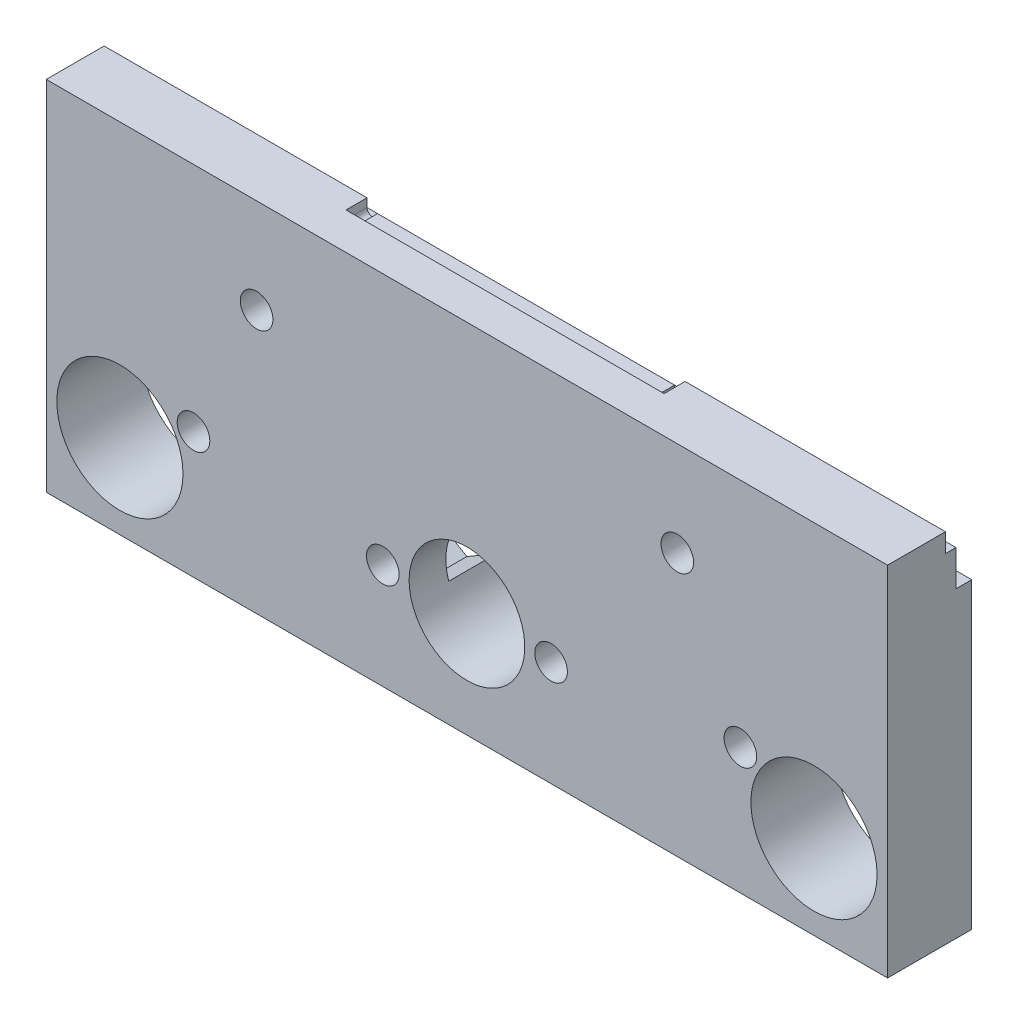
ISO-10303-21;
HEADER;
FILE_DESCRIPTION(('STEP AP214'),'2;1');
FILE_NAME('part.step','',(''),(''),'','','');
FILE_SCHEMA(('AUTOMOTIVE_DESIGN { 1 0 10303 214 1 1 1 1 }'));
ENDSEC;
DATA;
#1=APPLICATION_CONTEXT('core data for automotive mechanical design processes');
#2=APPLICATION_PROTOCOL_DEFINITION('international standard','automotive_design',2000,#1);
#3=PRODUCT_CONTEXT('',#1,'mechanical');
#4=PRODUCT('Part','Part','',(#3));
#5=PRODUCT_RELATED_PRODUCT_CATEGORY('part','',(#4));
#6=PRODUCT_DEFINITION_FORMATION('','',#4);
#7=PRODUCT_DEFINITION_CONTEXT('part definition',#1,'design');
#8=PRODUCT_DEFINITION('design','',#6,#7);
#9=PRODUCT_DEFINITION_SHAPE('','',#8);
#10=(LENGTH_UNIT() NAMED_UNIT(*) SI_UNIT(.MILLI.,.METRE.));
#11=(NAMED_UNIT(*) PLANE_ANGLE_UNIT() SI_UNIT($,.RADIAN.));
#12=(NAMED_UNIT(*) SI_UNIT($,.STERADIAN.) SOLID_ANGLE_UNIT());
#13=UNCERTAINTY_MEASURE_WITH_UNIT(LENGTH_MEASURE(1.E-05),#10,'distance_accuracy_value','');
#14=(GEOMETRIC_REPRESENTATION_CONTEXT(3) GLOBAL_UNCERTAINTY_ASSIGNED_CONTEXT((#13)) GLOBAL_UNIT_ASSIGNED_CONTEXT((#10,
#11,#12)) REPRESENTATION_CONTEXT('',''));
#15=CARTESIAN_POINT('',(0.,0.,0.));
#16=DIRECTION('',(0.,0.,1.));
#17=DIRECTION('',(1.,0.,0.));
#18=AXIS2_PLACEMENT_3D('',#15,#16,#17);
#19=CARTESIAN_POINT('',(32.,10.,0.));
#20=DIRECTION('',(0.,0.,1.));
#21=DIRECTION('',(1.,0.,0.));
#22=AXIS2_PLACEMENT_3D('',#19,#20,#21);
#23=CYLINDRICAL_SURFACE('',#22,1.55);
#24=CARTESIAN_POINT('',(32.,10.,8.));
#25=DIRECTION('',(0.,0.,1.));
#26=DIRECTION('',(1.,0.,0.));
#27=AXIS2_PLACEMENT_3D('',#24,#25,#26);
#28=CIRCLE('',#27,1.55);
#29=CARTESIAN_POINT('',(33.55,10.,8.));
#30=VERTEX_POINT('',#29);
#31=EDGE_CURVE('E259',#30,#30,#28,.T.);
#32=ORIENTED_EDGE('',*,*,#31,.T.);
#33=EDGE_LOOP('',(#32));
#34=FACE_BOUND('',#33,.T.);
#35=CARTESIAN_POINT('',(32.,10.,4.5));
#36=DIRECTION('',(0.,0.,-1.));
#37=DIRECTION('',(-1.,0.,0.));
#38=AXIS2_PLACEMENT_3D('',#35,#36,#37);
#39=CIRCLE('',#38,1.55);
#40=CARTESIAN_POINT('',(30.45,10.,4.5));
#41=VERTEX_POINT('',#40);
#42=EDGE_CURVE('E262',#41,#41,#39,.F.);
#43=ORIENTED_EDGE('',*,*,#42,.F.);
#44=EDGE_LOOP('',(#43));
#45=FACE_BOUND('',#44,.T.);
#46=ADVANCED_FACE('F33',(#34,#45),#23,.F.);
#47=CARTESIAN_POINT('',(48.,10.,0.));
#48=DIRECTION('',(0.,0.,1.));
#49=DIRECTION('',(1.,0.,0.));
#50=AXIS2_PLACEMENT_3D('',#47,#48,#49);
#51=CYLINDRICAL_SURFACE('',#50,1.55);
#52=CARTESIAN_POINT('',(48.,10.,8.));
#53=DIRECTION('',(0.,0.,1.));
#54=DIRECTION('',(1.,0.,0.));
#55=AXIS2_PLACEMENT_3D('',#52,#53,#54);
#56=CIRCLE('',#55,1.55);
#57=CARTESIAN_POINT('',(49.55,10.,8.));
#58=VERTEX_POINT('',#57);
#59=EDGE_CURVE('E255',#58,#58,#56,.T.);
#60=ORIENTED_EDGE('',*,*,#59,.T.);
#61=EDGE_LOOP('',(#60));
#62=FACE_BOUND('',#61,.T.);
#63=CARTESIAN_POINT('',(48.,10.,4.5));
#64=DIRECTION('',(0.,0.,-1.));
#65=DIRECTION('',(-1.,0.,0.));
#66=AXIS2_PLACEMENT_3D('',#63,#64,#65);
#67=CIRCLE('',#66,1.55);
#68=CARTESIAN_POINT('',(46.45,10.,4.5));
#69=VERTEX_POINT('',#68);
#70=EDGE_CURVE('E337',#69,#69,#67,.F.);
#71=ORIENTED_EDGE('',*,*,#70,.F.);
#72=EDGE_LOOP('',(#71));
#73=FACE_BOUND('',#72,.T.);
#74=ADVANCED_FACE('F346',(#62,#73),#51,.F.);
#75=CARTESIAN_POINT('',(0.,0.,8.));
#76=DIRECTION('',(0.,0.,1.));
#77=DIRECTION('',(1.,0.,0.));
#78=AXIS2_PLACEMENT_3D('',#75,#76,#77);
#79=PLANE('',#78);
#80=CARTESIAN_POINT('',(40.,10.,8.));
#81=DIRECTION('',(0.,0.,-1.));
#82=DIRECTION('',(-1.,0.,0.));
#83=AXIS2_PLACEMENT_3D('',#80,#81,#82);
#84=CIRCLE('',#83,5.5);
#85=CARTESIAN_POINT('',(34.5,10.,8.));
#86=VERTEX_POINT('',#85);
#87=EDGE_CURVE('E226',#86,#86,#84,.T.);
#88=ORIENTED_EDGE('',*,*,#87,.T.);
#89=EDGE_LOOP('',(#88));
#90=FACE_BOUND('',#89,.T.);
#91=CARTESIAN_POINT('',(66.,11.9999999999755,8.));
#92=DIRECTION('',(0.,0.,-1.));
#93=DIRECTION('',(-1.,0.,0.));
#94=AXIS2_PLACEMENT_3D('',#91,#92,#93);
#95=CIRCLE('',#94,1.54999999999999);
#96=CARTESIAN_POINT('',(64.45,11.9999999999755,8.));
#97=VERTEX_POINT('',#96);
#98=EDGE_CURVE('E546',#97,#97,#95,.T.);
#99=ORIENTED_EDGE('',*,*,#98,.T.);
#100=EDGE_LOOP('',(#99));
#101=FACE_BOUND('',#100,.T.);
#102=CARTESIAN_POINT('',(14.,11.9999999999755,8.));
#103=DIRECTION('',(0.,0.,-1.));
#104=DIRECTION('',(1.,0.,0.));
#105=AXIS2_PLACEMENT_3D('',#102,#103,#104);
#106=CIRCLE('',#105,1.54999999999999);
#107=CARTESIAN_POINT('',(15.55,11.9999999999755,8.));
#108=VERTEX_POINT('',#107);
#109=EDGE_CURVE('E541',#108,#108,#106,.T.);
#110=ORIENTED_EDGE('',*,*,#109,.T.);
#111=EDGE_LOOP('',(#110));
#112=FACE_BOUND('',#111,.T.);
#113=CARTESIAN_POINT('',(60.,25.,8.));
#114=DIRECTION('',(0.,0.,-1.));
#115=DIRECTION('',(-1.,0.,0.));
#116=AXIS2_PLACEMENT_3D('',#113,#114,#115);
#117=CIRCLE('',#116,1.55000000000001);
#118=CARTESIAN_POINT('',(58.45,25.,8.));
#119=VERTEX_POINT('',#118);
#120=EDGE_CURVE('E444',#119,#119,#117,.T.);
#121=ORIENTED_EDGE('',*,*,#120,.T.);
#122=EDGE_LOOP('',(#121));
#123=FACE_BOUND('',#122,.T.);
#124=CARTESIAN_POINT('',(20.,25.,8.));
#125=DIRECTION('',(0.,0.,-1.));
#126=DIRECTION('',(-1.,0.,0.));
#127=AXIS2_PLACEMENT_3D('',#124,#125,#126);
#128=CIRCLE('',#127,1.55);
#129=CARTESIAN_POINT('',(18.45,25.,8.));
#130=VERTEX_POINT('',#129);
#131=EDGE_CURVE('E450',#130,#130,#128,.T.);
#132=ORIENTED_EDGE('',*,*,#131,.T.);
#133=EDGE_LOOP('',(#132));
#134=FACE_BOUND('',#133,.T.);
#135=ORIENTED_EDGE('',*,*,#59,.F.);
#136=EDGE_LOOP('',(#135));
#137=FACE_BOUND('',#136,.T.);
#138=ORIENTED_EDGE('',*,*,#31,.F.);
#139=EDGE_LOOP('',(#138));
#140=FACE_BOUND('',#139,.T.);
#141=DIRECTION('',(0.,-1.,0.));
#142=VECTOR('',#141,1.);
#143=CARTESIAN_POINT('',(0.,34.,8.));
#144=LINE('',#143,#142);
#145=CARTESIAN_POINT('',(0.,34.,8.));
#146=VERTEX_POINT('',#145);
#147=CARTESIAN_POINT('',(0.,0.,8.));
#148=VERTEX_POINT('',#147);
#149=EDGE_CURVE('E311',#146,#148,#144,.T.);
#150=ORIENTED_EDGE('',*,*,#149,.T.);
#151=DIRECTION('',(1.,0.,0.));
#152=VECTOR('',#151,1.);
#153=CARTESIAN_POINT('',(0.,0.,8.));
#154=LINE('',#153,#152);
#155=CARTESIAN_POINT('',(80.,0.,8.));
#156=VERTEX_POINT('',#155);
#157=EDGE_CURVE('E314',#148,#156,#154,.T.);
#158=ORIENTED_EDGE('',*,*,#157,.T.);
#159=DIRECTION('',(0.,1.,0.));
#160=VECTOR('',#159,1.);
#161=CARTESIAN_POINT('',(80.,0.,8.));
#162=LINE('',#161,#160);
#163=CARTESIAN_POINT('',(80.,34.,8.));
#164=VERTEX_POINT('',#163);
#165=EDGE_CURVE('E317',#156,#164,#162,.T.);
#166=ORIENTED_EDGE('',*,*,#165,.T.);
#167=DIRECTION('',(-1.,0.,0.));
#168=VECTOR('',#167,1.);
#169=CARTESIAN_POINT('',(80.,34.,8.));
#170=LINE('',#169,#168);
#171=EDGE_CURVE('E319',#164,#146,#170,.T.);
#172=ORIENTED_EDGE('',*,*,#171,.T.);
#173=EDGE_LOOP('',(#150,#158,#166,#172));
#174=FACE_BOUND('',#173,.T.);
#175=CARTESIAN_POINT('',(7.,8.,8.));
#176=DIRECTION('',(0.,0.,1.));
#177=DIRECTION('',(1.,0.,0.));
#178=AXIS2_PLACEMENT_3D('',#175,#176,#177);
#179=CIRCLE('',#178,6.);
#180=CARTESIAN_POINT('',(13.,8.,8.));
#181=VERTEX_POINT('',#180);
#182=EDGE_CURVE('E305',#181,#181,#179,.T.);
#183=ORIENTED_EDGE('',*,*,#182,.F.);
#184=EDGE_LOOP('',(#183));
#185=FACE_BOUND('',#184,.T.);
#186=CARTESIAN_POINT('',(73.,8.,8.));
#187=DIRECTION('',(0.,0.,1.));
#188=DIRECTION('',(1.,0.,0.));
#189=AXIS2_PLACEMENT_3D('',#186,#187,#188);
#190=CIRCLE('',#189,6.);
#191=CARTESIAN_POINT('',(79.,8.,8.));
#192=VERTEX_POINT('',#191);
#193=EDGE_CURVE('E299',#192,#192,#190,.T.);
#194=ORIENTED_EDGE('',*,*,#193,.F.);
#195=EDGE_LOOP('',(#194));
#196=FACE_BOUND('',#195,.T.);
#197=ADVANCED_FACE('F352',(#90,#101,#112,#123,#134,#137,#140,#174,#185,#196),#79,.T.);
#198=CARTESIAN_POINT('',(0.,0.,0.));
#199=DIRECTION('',(0.,0.,1.));
#200=DIRECTION('',(1.,0.,0.));
#201=AXIS2_PLACEMENT_3D('',#198,#199,#200);
#202=PLANE('',#201);
#203=CARTESIAN_POINT('',(66.,11.9999999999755,0.));
#204=DIRECTION('',(0.,0.,-1.));
#205=DIRECTION('',(-1.,0.,0.));
#206=AXIS2_PLACEMENT_3D('',#203,#204,#205);
#207=CIRCLE('',#206,1.54999999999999);
#208=CARTESIAN_POINT('',(64.45,11.9999999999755,0.));
#209=VERTEX_POINT('',#208);
#210=EDGE_CURVE('E550',#209,#209,#207,.T.);
#211=ORIENTED_EDGE('',*,*,#210,.F.);
#212=EDGE_LOOP('',(#211));
#213=FACE_BOUND('',#212,.T.);
#214=CARTESIAN_POINT('',(14.,11.9999999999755,0.));
#215=DIRECTION('',(0.,0.,-1.));
#216=DIRECTION('',(1.,0.,0.));
#217=AXIS2_PLACEMENT_3D('',#214,#215,#216);
#218=CIRCLE('',#217,1.54999999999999);
#219=CARTESIAN_POINT('',(15.55,11.9999999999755,0.));
#220=VERTEX_POINT('',#219);
#221=EDGE_CURVE('E537',#220,#220,#218,.T.);
#222=ORIENTED_EDGE('',*,*,#221,.F.);
#223=EDGE_LOOP('',(#222));
#224=FACE_BOUND('',#223,.T.);
#225=CARTESIAN_POINT('',(60.,25.,0.));
#226=DIRECTION('',(0.,0.,-1.));
#227=DIRECTION('',(-1.,0.,0.));
#228=AXIS2_PLACEMENT_3D('',#225,#226,#227);
#229=CIRCLE('',#228,1.55000000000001);
#230=CARTESIAN_POINT('',(58.45,25.,0.));
#231=VERTEX_POINT('',#230);
#232=EDGE_CURVE('E447',#231,#231,#229,.T.);
#233=ORIENTED_EDGE('',*,*,#232,.F.);
#234=EDGE_LOOP('',(#233));
#235=FACE_BOUND('',#234,.T.);
#236=CARTESIAN_POINT('',(20.,25.,0.));
#237=DIRECTION('',(0.,0.,-1.));
#238=DIRECTION('',(-1.,0.,0.));
#239=AXIS2_PLACEMENT_3D('',#236,#237,#238);
#240=CIRCLE('',#239,1.55);
#241=CARTESIAN_POINT('',(18.45,25.,0.));
#242=VERTEX_POINT('',#241);
#243=EDGE_CURVE('E453',#242,#242,#240,.T.);
#244=ORIENTED_EDGE('',*,*,#243,.F.);
#245=EDGE_LOOP('',(#244));
#246=FACE_BOUND('',#245,.T.);
#247=DIRECTION('',(0.866025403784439,0.5,0.));
#248=VECTOR('',#247,1.);
#249=CARTESIAN_POINT('',(45.15,11.6454482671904,0.));
#250=LINE('',#249,#248);
#251=CARTESIAN_POINT('',(45.2328562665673,11.6932853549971,0.));
#252=VERTEX_POINT('',#251);
#253=CARTESIAN_POINT('',(48.,13.2908965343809,0.));
#254=VERTEX_POINT('',#253);
#255=EDGE_CURVE('E225',#252,#254,#250,.T.);
#256=ORIENTED_EDGE('',*,*,#255,.F.);
#257=CARTESIAN_POINT('',(40.,10.,0.));
#258=DIRECTION('',(0.,0.,-1.));
#259=DIRECTION('',(-1.,0.,0.));
#260=AXIS2_PLACEMENT_3D('',#257,#258,#259);
#261=CIRCLE('',#260,5.5);
#262=CARTESIAN_POINT('',(34.7671437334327,11.6932853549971,0.));
#263=VERTEX_POINT('',#262);
#264=EDGE_CURVE('E207',#263,#252,#261,.T.);
#265=ORIENTED_EDGE('',*,*,#264,.F.);
#266=DIRECTION('',(0.866025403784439,-0.499999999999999,0.));
#267=VECTOR('',#266,1.);
#268=CARTESIAN_POINT('',(32.,13.2908965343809,0.));
#269=LINE('',#268,#267);
#270=CARTESIAN_POINT('',(32.,13.2908965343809,0.));
#271=VERTEX_POINT('',#270);
#272=EDGE_CURVE('E223',#271,#263,#269,.T.);
#273=ORIENTED_EDGE('',*,*,#272,.F.);
#274=DIRECTION('',(0.866025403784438,0.500000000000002,0.));
#275=VECTOR('',#274,1.);
#276=CARTESIAN_POINT('',(29.15,11.6454482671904,0.));
#277=LINE('',#276,#275);
#278=CARTESIAN_POINT('',(29.15,11.6454482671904,0.));
#279=VERTEX_POINT('',#278);
#280=EDGE_CURVE('E254',#279,#271,#277,.T.);
#281=ORIENTED_EDGE('',*,*,#280,.F.);
#282=DIRECTION('',(0.,1.,0.));
#283=VECTOR('',#282,1.);
#284=CARTESIAN_POINT('',(29.15,8.35455173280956,0.));
#285=LINE('',#284,#283);
#286=CARTESIAN_POINT('',(29.15,8.35455173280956,0.));
#287=VERTEX_POINT('',#286);
#288=EDGE_CURVE('E497',#287,#279,#285,.T.);
#289=ORIENTED_EDGE('',*,*,#288,.F.);
#290=DIRECTION('',(-0.866025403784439,0.499999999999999,0.));
#291=VECTOR('',#290,1.);
#292=CARTESIAN_POINT('',(32.,6.70910346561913,0.));
#293=LINE('',#292,#291);
#294=CARTESIAN_POINT('',(32.,6.70910346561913,0.));
#295=VERTEX_POINT('',#294);
#296=EDGE_CURVE('E236',#295,#287,#293,.T.);
#297=ORIENTED_EDGE('',*,*,#296,.F.);
#298=DIRECTION('',(-0.866025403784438,-0.500000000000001,0.));
#299=VECTOR('',#298,1.);
#300=CARTESIAN_POINT('',(34.85,8.35455173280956,0.));
#301=LINE('',#300,#299);
#302=CARTESIAN_POINT('',(34.7671437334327,8.3067146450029,0.));
#303=VERTEX_POINT('',#302);
#304=EDGE_CURVE('E232',#303,#295,#301,.T.);
#305=ORIENTED_EDGE('',*,*,#304,.F.);
#306=CARTESIAN_POINT('',(45.2328562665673,8.30671464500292,0.));
#307=VERTEX_POINT('',#306);
#308=EDGE_CURVE('E48',#307,#303,#261,.T.);
#309=ORIENTED_EDGE('',*,*,#308,.F.);
#310=DIRECTION('',(-0.866025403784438,0.5,0.));
#311=VECTOR('',#310,1.);
#312=CARTESIAN_POINT('',(48.,6.70910346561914,0.));
#313=LINE('',#312,#311);
#314=CARTESIAN_POINT('',(48.,6.70910346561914,0.));
#315=VERTEX_POINT('',#314);
#316=EDGE_CURVE('E477',#315,#307,#313,.T.);
#317=ORIENTED_EDGE('',*,*,#316,.F.);
#318=DIRECTION('',(-0.866025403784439,-0.5,0.));
#319=VECTOR('',#318,1.);
#320=CARTESIAN_POINT('',(50.85,8.35455173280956,0.));
#321=LINE('',#320,#319);
#322=CARTESIAN_POINT('',(50.85,8.35455173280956,0.));
#323=VERTEX_POINT('',#322);
#324=EDGE_CURVE('E474',#323,#315,#321,.T.);
#325=ORIENTED_EDGE('',*,*,#324,.F.);
#326=DIRECTION('',(0.,-1.,0.));
#327=VECTOR('',#326,1.);
#328=CARTESIAN_POINT('',(50.85,11.6454482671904,0.));
#329=LINE('',#328,#327);
#330=CARTESIAN_POINT('',(50.85,11.6454482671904,0.));
#331=VERTEX_POINT('',#330);
#332=EDGE_CURVE('E234',#331,#323,#329,.T.);
#333=ORIENTED_EDGE('',*,*,#332,.F.);
#334=DIRECTION('',(0.866025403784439,-0.5,0.));
#335=VECTOR('',#334,1.);
#336=CARTESIAN_POINT('',(48.,13.2908965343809,0.));
#337=LINE('',#336,#335);
#338=EDGE_CURVE('E231',#254,#331,#337,.T.);
#339=ORIENTED_EDGE('',*,*,#338,.F.);
#340=EDGE_LOOP('',(#256,#265,#273,#281,#289,#297,#305,#309,#317,#325,#333,#339));
#341=FACE_BOUND('',#340,.T.);
#342=DIRECTION('',(0.,-1.,0.));
#343=VECTOR('',#342,1.);
#344=CARTESIAN_POINT('',(0.,34.,0.));
#345=LINE('',#344,#343);
#346=CARTESIAN_POINT('',(0.,28.7999999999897,0.));
#347=VERTEX_POINT('',#346);
#348=CARTESIAN_POINT('',(0.,0.,0.));
#349=VERTEX_POINT('',#348);
#350=EDGE_CURVE('E308',#347,#349,#345,.T.);
#351=ORIENTED_EDGE('',*,*,#350,.F.);
#352=DIRECTION('',(1.,0.,0.));
#353=VECTOR('',#352,1.);
#354=CARTESIAN_POINT('',(0.,28.7999999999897,0.));
#355=LINE('',#354,#353);
#356=CARTESIAN_POINT('',(80.,28.7999999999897,0.));
#357=VERTEX_POINT('',#356);
#358=EDGE_CURVE('E286',#347,#357,#355,.T.);
#359=ORIENTED_EDGE('',*,*,#358,.T.);
#360=DIRECTION('',(0.,1.,0.));
#361=VECTOR('',#360,1.);
#362=CARTESIAN_POINT('',(80.,0.,0.));
#363=LINE('',#362,#361);
#364=CARTESIAN_POINT('',(80.,0.,0.));
#365=VERTEX_POINT('',#364);
#366=EDGE_CURVE('E315',#365,#357,#363,.T.);
#367=ORIENTED_EDGE('',*,*,#366,.F.);
#368=DIRECTION('',(1.,0.,0.));
#369=VECTOR('',#368,1.);
#370=CARTESIAN_POINT('',(0.,0.,0.));
#371=LINE('',#370,#369);
#372=EDGE_CURVE('E323',#349,#365,#371,.T.);
#373=ORIENTED_EDGE('',*,*,#372,.F.);
#374=EDGE_LOOP('',(#351,#359,#367,#373));
#375=FACE_BOUND('',#374,.T.);
#376=CARTESIAN_POINT('',(7.,8.,0.));
#377=DIRECTION('',(0.,0.,1.));
#378=DIRECTION('',(1.,0.,0.));
#379=AXIS2_PLACEMENT_3D('',#376,#377,#378);
#380=CIRCLE('',#379,6.);
#381=CARTESIAN_POINT('',(13.,8.,0.));
#382=VERTEX_POINT('',#381);
#383=EDGE_CURVE('E302',#382,#382,#380,.T.);
#384=ORIENTED_EDGE('',*,*,#383,.T.);
#385=EDGE_LOOP('',(#384));
#386=FACE_BOUND('',#385,.T.);
#387=CARTESIAN_POINT('',(73.,8.,0.));
#388=DIRECTION('',(0.,0.,1.));
#389=DIRECTION('',(1.,0.,0.));
#390=AXIS2_PLACEMENT_3D('',#387,#388,#389);
#391=CIRCLE('',#390,6.);
#392=CARTESIAN_POINT('',(79.,8.,0.));
#393=VERTEX_POINT('',#392);
#394=EDGE_CURVE('E289',#393,#393,#391,.T.);
#395=ORIENTED_EDGE('',*,*,#394,.T.);
#396=EDGE_LOOP('',(#395));
#397=FACE_BOUND('',#396,.T.);
#398=ADVANCED_FACE('F220',(#213,#224,#235,#246,#341,#375,#386,#397),#202,.F.);
#399=CARTESIAN_POINT('',(0.,34.,8.));
#400=DIRECTION('',(1.,0.,0.));
#401=DIRECTION('',(0.,0.,-1.));
#402=AXIS2_PLACEMENT_3D('',#399,#400,#401);
#403=PLANE('',#402);
#404=DIRECTION('',(0.,-1.,0.));
#405=VECTOR('',#404,1.);
#406=CARTESIAN_POINT('',(0.,32.2,1.5));
#407=LINE('',#406,#405);
#408=CARTESIAN_POINT('',(0.,32.2,1.5));
#409=VERTEX_POINT('',#408);
#410=CARTESIAN_POINT('',(0.,28.8,1.5));
#411=VERTEX_POINT('',#410);
#412=EDGE_CURVE('E270',#409,#411,#407,.T.);
#413=ORIENTED_EDGE('',*,*,#412,.T.);
#414=DIRECTION('',(0.,-6.85562717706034E-12,-1.));
#415=VECTOR('',#414,1.);
#416=CARTESIAN_POINT('',(0.,28.8,1.5));
#417=LINE('',#416,#415);
#418=EDGE_CURVE('E273',#411,#347,#417,.T.);
#419=ORIENTED_EDGE('',*,*,#418,.T.);
#420=ORIENTED_EDGE('',*,*,#350,.T.);
#421=DIRECTION('',(0.,0.,-1.));
#422=VECTOR('',#421,1.);
#423=CARTESIAN_POINT('',(0.,0.,8.));
#424=LINE('',#423,#422);
#425=EDGE_CURVE('E41',#148,#349,#424,.T.);
#426=ORIENTED_EDGE('',*,*,#425,.F.);
#427=ORIENTED_EDGE('',*,*,#149,.F.);
#428=DIRECTION('',(0.,0.,-1.));
#429=VECTOR('',#428,1.);
#430=CARTESIAN_POINT('',(0.,34.,8.));
#431=LINE('',#430,#429);
#432=CARTESIAN_POINT('',(0.,34.,2.5));
#433=VERTEX_POINT('',#432);
#434=EDGE_CURVE('E321',#146,#433,#431,.T.);
#435=ORIENTED_EDGE('',*,*,#434,.T.);
#436=DIRECTION('',(0.,-1.,0.));
#437=VECTOR('',#436,1.);
#438=CARTESIAN_POINT('',(0.,32.2,2.5));
#439=LINE('',#438,#437);
#440=CARTESIAN_POINT('',(0.,32.2,2.5));
#441=VERTEX_POINT('',#440);
#442=EDGE_CURVE('E263',#433,#441,#439,.T.);
#443=ORIENTED_EDGE('',*,*,#442,.T.);
#444=DIRECTION('',(0.,0.,-1.));
#445=VECTOR('',#444,1.);
#446=CARTESIAN_POINT('',(0.,32.2,1.5));
#447=LINE('',#446,#445);
#448=EDGE_CURVE('E266',#441,#409,#447,.T.);
#449=ORIENTED_EDGE('',*,*,#448,.T.);
#450=EDGE_LOOP('',(#413,#419,#420,#426,#427,#435,#443,#449));
#451=FACE_BOUND('',#450,.T.);
#452=ADVANCED_FACE('F35',(#451),#403,.F.);
#453=CARTESIAN_POINT('',(0.,0.,8.));
#454=DIRECTION('',(0.,1.,0.));
#455=DIRECTION('',(0.,0.,1.));
#456=AXIS2_PLACEMENT_3D('',#453,#454,#455);
#457=PLANE('',#456);
#458=ORIENTED_EDGE('',*,*,#372,.T.);
#459=DIRECTION('',(0.,0.,-1.));
#460=VECTOR('',#459,1.);
#461=CARTESIAN_POINT('',(80.,0.,8.));
#462=LINE('',#461,#460);
#463=EDGE_CURVE('E332',#156,#365,#462,.T.);
#464=ORIENTED_EDGE('',*,*,#463,.F.);
#465=ORIENTED_EDGE('',*,*,#157,.F.);
#466=ORIENTED_EDGE('',*,*,#425,.T.);
#467=EDGE_LOOP('',(#458,#464,#465,#466));
#468=FACE_BOUND('',#467,.T.);
#469=ADVANCED_FACE('F394',(#468),#457,.F.);
#470=CARTESIAN_POINT('',(80.,0.,8.));
#471=DIRECTION('',(-1.,0.,0.));
#472=DIRECTION('',(0.,0.,1.));
#473=AXIS2_PLACEMENT_3D('',#470,#471,#472);
#474=PLANE('',#473);
#475=ORIENTED_EDGE('',*,*,#366,.T.);
#476=DIRECTION('',(0.,-6.85562717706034E-12,-1.));
#477=VECTOR('',#476,1.);
#478=CARTESIAN_POINT('',(80.,28.8,1.5));
#479=LINE('',#478,#477);
#480=CARTESIAN_POINT('',(80.,28.8,1.5));
#481=VERTEX_POINT('',#480);
#482=EDGE_CURVE('E267',#481,#357,#479,.T.);
#483=ORIENTED_EDGE('',*,*,#482,.F.);
#484=DIRECTION('',(0.,-1.,0.));
#485=VECTOR('',#484,1.);
#486=CARTESIAN_POINT('',(80.,32.2,1.5));
#487=LINE('',#486,#485);
#488=CARTESIAN_POINT('',(80.,32.2,1.5));
#489=VERTEX_POINT('',#488);
#490=EDGE_CURVE('E282',#489,#481,#487,.T.);
#491=ORIENTED_EDGE('',*,*,#490,.F.);
#492=DIRECTION('',(0.,0.,-1.));
#493=VECTOR('',#492,1.);
#494=CARTESIAN_POINT('',(80.,32.2,1.5));
#495=LINE('',#494,#493);
#496=CARTESIAN_POINT('',(80.,32.2,2.5));
#497=VERTEX_POINT('',#496);
#498=EDGE_CURVE('E279',#497,#489,#495,.T.);
#499=ORIENTED_EDGE('',*,*,#498,.F.);
#500=DIRECTION('',(0.,-1.,0.));
#501=VECTOR('',#500,1.);
#502=CARTESIAN_POINT('',(80.,32.2,2.5));
#503=LINE('',#502,#501);
#504=CARTESIAN_POINT('',(80.,34.,2.5));
#505=VERTEX_POINT('',#504);
#506=EDGE_CURVE('E258',#505,#497,#503,.T.);
#507=ORIENTED_EDGE('',*,*,#506,.F.);
#508=DIRECTION('',(0.,0.,-1.));
#509=VECTOR('',#508,1.);
#510=CARTESIAN_POINT('',(80.,34.,8.));
#511=LINE('',#510,#509);
#512=EDGE_CURVE('E329',#164,#505,#511,.T.);
#513=ORIENTED_EDGE('',*,*,#512,.F.);
#514=ORIENTED_EDGE('',*,*,#165,.F.);
#515=ORIENTED_EDGE('',*,*,#463,.T.);
#516=EDGE_LOOP('',(#475,#483,#491,#499,#507,#513,#514,#515));
#517=FACE_BOUND('',#516,.T.);
#518=ADVANCED_FACE('F391',(#517),#474,.F.);
#519=CARTESIAN_POINT('',(80.,34.,8.));
#520=DIRECTION('',(0.,-1.,0.));
#521=DIRECTION('',(1.,0.,0.));
#522=AXIS2_PLACEMENT_3D('',#519,#520,#521);
#523=PLANE('',#522);
#524=DIRECTION('',(1.,0.,0.));
#525=VECTOR('',#524,1.);
#526=CARTESIAN_POINT('',(25.000000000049,34.,4.49999999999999));
#527=LINE('',#526,#525);
#528=CARTESIAN_POINT('',(25.000000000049,34.,4.49999999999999));
#529=VERTEX_POINT('',#528);
#530=CARTESIAN_POINT('',(55.247938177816,34.,4.49999999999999));
#531=VERTEX_POINT('',#530);
#532=EDGE_CURVE('E431',#529,#531,#527,.T.);
#533=ORIENTED_EDGE('',*,*,#532,.F.);
#534=DIRECTION('',(0.,0.,-1.));
#535=VECTOR('',#534,1.);
#536=CARTESIAN_POINT('',(25.000000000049,34.,4.49999999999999));
#537=LINE('',#536,#535);
#538=CARTESIAN_POINT('',(25.000000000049,34.,2.49999999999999));
#539=VERTEX_POINT('',#538);
#540=EDGE_CURVE('E429',#529,#539,#537,.T.);
#541=ORIENTED_EDGE('',*,*,#540,.T.);
#542=DIRECTION('',(1.,0.,0.));
#543=VECTOR('',#542,1.);
#544=CARTESIAN_POINT('',(0.,34.,2.5));
#545=LINE('',#544,#543);
#546=EDGE_CURVE('E296',#433,#539,#545,.T.);
#547=ORIENTED_EDGE('',*,*,#546,.F.);
#548=ORIENTED_EDGE('',*,*,#434,.F.);
#549=ORIENTED_EDGE('',*,*,#171,.F.);
#550=ORIENTED_EDGE('',*,*,#512,.T.);
#551=CARTESIAN_POINT('',(55.247938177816,34.,2.5));
#552=VERTEX_POINT('',#551);
#553=EDGE_CURVE('E276',#552,#505,#545,.T.);
#554=ORIENTED_EDGE('',*,*,#553,.F.);
#555=DIRECTION('',(0.,0.,-1.));
#556=VECTOR('',#555,1.);
#557=CARTESIAN_POINT('',(55.247938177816,34.,4.49999999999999));
#558=LINE('',#557,#556);
#559=EDGE_CURVE('E55',#531,#552,#558,.T.);
#560=ORIENTED_EDGE('',*,*,#559,.F.);
#561=EDGE_LOOP('',(#533,#541,#547,#548,#549,#550,#554,#560));
#562=FACE_BOUND('',#561,.T.);
#563=ADVANCED_FACE('F381',(#562),#523,.F.);
#564=CARTESIAN_POINT('',(7.,8.,8.));
#565=DIRECTION('',(0.,0.,-1.));
#566=DIRECTION('',(-1.,0.,0.));
#567=AXIS2_PLACEMENT_3D('',#564,#565,#566);
#568=CYLINDRICAL_SURFACE('',#567,6.);
#569=ORIENTED_EDGE('',*,*,#182,.T.);
#570=EDGE_LOOP('',(#569));
#571=FACE_BOUND('',#570,.T.);
#572=ORIENTED_EDGE('',*,*,#383,.F.);
#573=EDGE_LOOP('',(#572));
#574=FACE_BOUND('',#573,.T.);
#575=ADVANCED_FACE('F377',(#571,#574),#568,.F.);
#576=CARTESIAN_POINT('',(73.,8.,8.));
#577=DIRECTION('',(0.,0.,-1.));
#578=DIRECTION('',(-1.,0.,0.));
#579=AXIS2_PLACEMENT_3D('',#576,#577,#578);
#580=CYLINDRICAL_SURFACE('',#579,6.);
#581=ORIENTED_EDGE('',*,*,#193,.T.);
#582=EDGE_LOOP('',(#581));
#583=FACE_BOUND('',#582,.T.);
#584=ORIENTED_EDGE('',*,*,#394,.F.);
#585=EDGE_LOOP('',(#584));
#586=FACE_BOUND('',#585,.T.);
#587=ADVANCED_FACE('F361',(#583,#586),#580,.F.);
#588=CARTESIAN_POINT('',(0.,28.8,1.5));
#589=DIRECTION('',(0.,-1.,6.85562717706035E-12));
#590=DIRECTION('',(0.,-6.85562717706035E-12,-1.));
#591=AXIS2_PLACEMENT_3D('',#588,#589,#590);
#592=PLANE('',#591);
#593=ORIENTED_EDGE('',*,*,#482,.T.);
#594=ORIENTED_EDGE('',*,*,#358,.F.);
#595=ORIENTED_EDGE('',*,*,#418,.F.);
#596=DIRECTION('',(1.,0.,0.));
#597=VECTOR('',#596,1.);
#598=CARTESIAN_POINT('',(0.,28.8,1.5));
#599=LINE('',#598,#597);
#600=EDGE_CURVE('E290',#411,#481,#599,.T.);
#601=ORIENTED_EDGE('',*,*,#600,.T.);
#602=EDGE_LOOP('',(#593,#594,#595,#601));
#603=FACE_BOUND('',#602,.T.);
#604=ADVANCED_FACE('F357',(#603),#592,.F.);
#605=CARTESIAN_POINT('',(0.,32.2,1.5));
#606=DIRECTION('',(0.,0.,1.));
#607=DIRECTION('',(0.,-1.,0.));
#608=AXIS2_PLACEMENT_3D('',#605,#606,#607);
#609=PLANE('',#608);
#610=ORIENTED_EDGE('',*,*,#490,.T.);
#611=ORIENTED_EDGE('',*,*,#600,.F.);
#612=ORIENTED_EDGE('',*,*,#412,.F.);
#613=DIRECTION('',(1.,0.,0.));
#614=VECTOR('',#613,1.);
#615=CARTESIAN_POINT('',(0.,32.2,1.5));
#616=LINE('',#615,#614);
#617=EDGE_CURVE('E292',#409,#489,#616,.T.);
#618=ORIENTED_EDGE('',*,*,#617,.T.);
#619=EDGE_LOOP('',(#610,#611,#612,#618));
#620=FACE_BOUND('',#619,.T.);
#621=ADVANCED_FACE('F360',(#620),#609,.F.);
#622=CARTESIAN_POINT('',(0.,32.2,1.5));
#623=DIRECTION('',(0.,-1.,0.));
#624=DIRECTION('',(0.,0.,-1.));
#625=AXIS2_PLACEMENT_3D('',#622,#623,#624);
#626=PLANE('',#625);
#627=ORIENTED_EDGE('',*,*,#498,.T.);
#628=ORIENTED_EDGE('',*,*,#617,.F.);
#629=ORIENTED_EDGE('',*,*,#448,.F.);
#630=DIRECTION('',(1.,0.,0.));
#631=VECTOR('',#630,1.);
#632=CARTESIAN_POINT('',(0.,32.2,2.5));
#633=LINE('',#632,#631);
#634=EDGE_CURVE('E294',#441,#497,#633,.T.);
#635=ORIENTED_EDGE('',*,*,#634,.T.);
#636=EDGE_LOOP('',(#627,#628,#629,#635));
#637=FACE_BOUND('',#636,.T.);
#638=ADVANCED_FACE('F365',(#637),#626,.F.);
#639=CARTESIAN_POINT('',(0.,32.2,2.5));
#640=DIRECTION('',(0.,0.,1.));
#641=DIRECTION('',(0.,-1.,0.));
#642=AXIS2_PLACEMENT_3D('',#639,#640,#641);
#643=PLANE('',#642);
#644=ORIENTED_EDGE('',*,*,#546,.T.);
#645=DIRECTION('',(0.,1.,0.));
#646=VECTOR('',#645,1.);
#647=CARTESIAN_POINT('',(25.000000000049,34.,2.49999999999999));
#648=LINE('',#647,#646);
#649=CARTESIAN_POINT('',(25.000000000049,33.2,2.49999999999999));
#650=VERTEX_POINT('',#649);
#651=EDGE_CURVE('E549',#650,#539,#648,.T.);
#652=ORIENTED_EDGE('',*,*,#651,.F.);
#653=CARTESIAN_POINT('',(25.500000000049,33.2,2.49999999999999));
#654=DIRECTION('',(0.,0.,-1.));
#655=DIRECTION('',(-1.,0.,0.));
#656=AXIS2_PLACEMENT_3D('',#653,#654,#655);
#657=CIRCLE('',#656,0.500000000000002);
#658=CARTESIAN_POINT('',(26.000000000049,33.2,2.49999999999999));
#659=VERTEX_POINT('',#658);
#660=EDGE_CURVE('E557',#659,#650,#657,.T.);
#661=ORIENTED_EDGE('',*,*,#660,.F.);
#662=DIRECTION('',(-1.,0.,0.));
#663=VECTOR('',#662,1.);
#664=CARTESIAN_POINT('',(26.000000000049,33.2,2.49999999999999));
#665=LINE('',#664,#663);
#666=CARTESIAN_POINT('',(54.247938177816,33.2,2.49999999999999));
#667=VERTEX_POINT('',#666);
#668=EDGE_CURVE('E572',#667,#659,#665,.T.);
#669=ORIENTED_EDGE('',*,*,#668,.F.);
#670=CARTESIAN_POINT('',(54.747938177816,33.2,2.49999999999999));
#671=DIRECTION('',(0.,0.,-1.));
#672=DIRECTION('',(-1.,0.,0.));
#673=AXIS2_PLACEMENT_3D('',#670,#671,#672);
#674=CIRCLE('',#673,0.5);
#675=CARTESIAN_POINT('',(55.247938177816,33.2,2.49999999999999));
#676=VERTEX_POINT('',#675);
#677=EDGE_CURVE('E569',#676,#667,#674,.T.);
#678=ORIENTED_EDGE('',*,*,#677,.F.);
#679=DIRECTION('',(0.,-1.,0.));
#680=VECTOR('',#679,1.);
#681=CARTESIAN_POINT('',(55.247938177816,34.,2.49999999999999));
#682=LINE('',#681,#680);
#683=EDGE_CURVE('E419',#552,#676,#682,.T.);
#684=ORIENTED_EDGE('',*,*,#683,.F.);
#685=ORIENTED_EDGE('',*,*,#553,.T.);
#686=ORIENTED_EDGE('',*,*,#506,.T.);
#687=ORIENTED_EDGE('',*,*,#634,.F.);
#688=ORIENTED_EDGE('',*,*,#442,.F.);
#689=EDGE_LOOP('',(#644,#652,#661,#669,#678,#684,#685,#686,#687,#688));
#690=FACE_BOUND('',#689,.T.);
#691=ADVANCED_FACE('F369',(#690),#643,.F.);
#692=CARTESIAN_POINT('',(0.,0.,4.5));
#693=DIRECTION('',(0.,0.,-1.));
#694=DIRECTION('',(-1.,0.,0.));
#695=AXIS2_PLACEMENT_3D('',#692,#693,#694);
#696=PLANE('',#695);
#697=CARTESIAN_POINT('',(40.,10.,4.5));
#698=DIRECTION('',(0.,0.,-1.));
#699=DIRECTION('',(-1.,0.,0.));
#700=AXIS2_PLACEMENT_3D('',#697,#698,#699);
#701=CIRCLE('',#700,5.5);
#702=CARTESIAN_POINT('',(45.2328562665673,11.6932853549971,4.5));
#703=VERTEX_POINT('',#702);
#704=CARTESIAN_POINT('',(45.2328562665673,8.30671464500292,4.5));
#705=VERTEX_POINT('',#704);
#706=EDGE_CURVE('E538',#703,#705,#701,.T.);
#707=ORIENTED_EDGE('',*,*,#706,.F.);
#708=DIRECTION('',(0.866025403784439,0.5,0.));
#709=VECTOR('',#708,1.);
#710=CARTESIAN_POINT('',(45.15,11.6454482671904,4.5));
#711=LINE('',#710,#709);
#712=CARTESIAN_POINT('',(48.,13.2908965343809,4.5));
#713=VERTEX_POINT('',#712);
#714=EDGE_CURVE('E469',#703,#713,#711,.T.);
#715=ORIENTED_EDGE('',*,*,#714,.T.);
#716=DIRECTION('',(0.866025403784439,-0.5,0.));
#717=VECTOR('',#716,1.);
#718=CARTESIAN_POINT('',(48.,13.2908965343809,4.5));
#719=LINE('',#718,#717);
#720=CARTESIAN_POINT('',(50.85,11.6454482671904,4.5));
#721=VERTEX_POINT('',#720);
#722=EDGE_CURVE('E457',#713,#721,#719,.T.);
#723=ORIENTED_EDGE('',*,*,#722,.T.);
#724=DIRECTION('',(0.,-1.,0.));
#725=VECTOR('',#724,1.);
#726=CARTESIAN_POINT('',(50.85,11.6454482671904,4.5));
#727=LINE('',#726,#725);
#728=CARTESIAN_POINT('',(50.85,8.35455173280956,4.5));
#729=VERTEX_POINT('',#728);
#730=EDGE_CURVE('E460',#721,#729,#727,.T.);
#731=ORIENTED_EDGE('',*,*,#730,.T.);
#732=DIRECTION('',(-0.866025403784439,-0.5,0.));
#733=VECTOR('',#732,1.);
#734=CARTESIAN_POINT('',(50.85,8.35455173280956,4.5));
#735=LINE('',#734,#733);
#736=CARTESIAN_POINT('',(48.,6.70910346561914,4.5));
#737=VERTEX_POINT('',#736);
#738=EDGE_CURVE('E463',#729,#737,#735,.T.);
#739=ORIENTED_EDGE('',*,*,#738,.T.);
#740=DIRECTION('',(-0.866025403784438,0.5,0.));
#741=VECTOR('',#740,1.);
#742=CARTESIAN_POINT('',(48.,6.70910346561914,4.5));
#743=LINE('',#742,#741);
#744=EDGE_CURVE('E466',#737,#705,#743,.T.);
#745=ORIENTED_EDGE('',*,*,#744,.T.);
#746=EDGE_LOOP('',(#707,#715,#723,#731,#739,#745));
#747=FACE_BOUND('',#746,.T.);
#748=ORIENTED_EDGE('',*,*,#70,.T.);
#749=EDGE_LOOP('',(#748));
#750=FACE_BOUND('',#749,.T.);
#751=ADVANCED_FACE('F373',(#747,#750),#696,.T.);
#752=CARTESIAN_POINT('',(48.,13.2908965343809,4.5));
#753=DIRECTION('',(0.5,0.866025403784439,0.));
#754=DIRECTION('',(-0.866025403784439,0.5,0.));
#755=AXIS2_PLACEMENT_3D('',#752,#753,#754);
#756=PLANE('',#755);
#757=ORIENTED_EDGE('',*,*,#338,.T.);
#758=DIRECTION('',(0.,0.,-1.));
#759=VECTOR('',#758,1.);
#760=CARTESIAN_POINT('',(50.85,11.6454482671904,4.5));
#761=LINE('',#760,#759);
#762=EDGE_CURVE('E470',#721,#331,#761,.T.);
#763=ORIENTED_EDGE('',*,*,#762,.F.);
#764=ORIENTED_EDGE('',*,*,#722,.F.);
#765=DIRECTION('',(0.,0.,-1.));
#766=VECTOR('',#765,1.);
#767=CARTESIAN_POINT('',(48.,13.2908965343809,4.5));
#768=LINE('',#767,#766);
#769=EDGE_CURVE('E339',#713,#254,#768,.T.);
#770=ORIENTED_EDGE('',*,*,#769,.T.);
#771=EDGE_LOOP('',(#757,#763,#764,#770));
#772=FACE_BOUND('',#771,.T.);
#773=ADVANCED_FACE('F530',(#772),#756,.F.);
#774=CARTESIAN_POINT('',(45.15,11.6454482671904,4.5));
#775=DIRECTION('',(-0.5,0.866025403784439,0.));
#776=DIRECTION('',(-0.866025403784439,-0.5,0.));
#777=AXIS2_PLACEMENT_3D('',#774,#775,#776);
#778=PLANE('',#777);
#779=ORIENTED_EDGE('',*,*,#714,.F.);
#780=DIRECTION('',(0.,0.,-1.));
#781=VECTOR('',#780,1.);
#782=CARTESIAN_POINT('',(45.2328562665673,11.6932853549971,8.));
#783=LINE('',#782,#781);
#784=EDGE_CURVE('E535',#703,#252,#783,.T.);
#785=ORIENTED_EDGE('',*,*,#784,.T.);
#786=ORIENTED_EDGE('',*,*,#255,.T.);
#787=ORIENTED_EDGE('',*,*,#769,.F.);
#788=EDGE_LOOP('',(#779,#785,#786,#787));
#789=FACE_BOUND('',#788,.T.);
#790=ADVANCED_FACE('F534',(#789),#778,.F.);
#791=CARTESIAN_POINT('',(48.,6.70910346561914,4.5));
#792=DIRECTION('',(-0.5,-0.866025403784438,0.));
#793=DIRECTION('',(0.866025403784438,-0.5,0.));
#794=AXIS2_PLACEMENT_3D('',#791,#792,#793);
#795=PLANE('',#794);
#796=ORIENTED_EDGE('',*,*,#316,.T.);
#797=DIRECTION('',(0.,0.,-1.));
#798=VECTOR('',#797,1.);
#799=CARTESIAN_POINT('',(45.2328562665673,8.30671464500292,8.));
#800=LINE('',#799,#798);
#801=EDGE_CURVE('E215',#307,#705,#800,.F.);
#802=ORIENTED_EDGE('',*,*,#801,.T.);
#803=ORIENTED_EDGE('',*,*,#744,.F.);
#804=DIRECTION('',(0.,0.,-1.));
#805=VECTOR('',#804,1.);
#806=CARTESIAN_POINT('',(48.,6.70910346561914,4.5));
#807=LINE('',#806,#805);
#808=EDGE_CURVE('E483',#737,#315,#807,.T.);
#809=ORIENTED_EDGE('',*,*,#808,.T.);
#810=EDGE_LOOP('',(#796,#802,#803,#809));
#811=FACE_BOUND('',#810,.T.);
#812=ADVANCED_FACE('F519',(#811),#795,.F.);
#813=CARTESIAN_POINT('',(50.85,8.35455173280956,4.5));
#814=DIRECTION('',(0.5,-0.866025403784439,0.));
#815=DIRECTION('',(0.866025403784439,0.5,0.));
#816=AXIS2_PLACEMENT_3D('',#813,#814,#815);
#817=PLANE('',#816);
#818=ORIENTED_EDGE('',*,*,#324,.T.);
#819=ORIENTED_EDGE('',*,*,#808,.F.);
#820=ORIENTED_EDGE('',*,*,#738,.F.);
#821=DIRECTION('',(0.,0.,-1.));
#822=VECTOR('',#821,1.);
#823=CARTESIAN_POINT('',(50.85,8.35455173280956,4.5));
#824=LINE('',#823,#822);
#825=EDGE_CURVE('E485',#729,#323,#824,.T.);
#826=ORIENTED_EDGE('',*,*,#825,.T.);
#827=EDGE_LOOP('',(#818,#819,#820,#826));
#828=FACE_BOUND('',#827,.T.);
#829=ADVANCED_FACE('F523',(#828),#817,.F.);
#830=CARTESIAN_POINT('',(50.85,11.6454482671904,4.5));
#831=DIRECTION('',(1.,0.,0.));
#832=DIRECTION('',(0.,0.,-1.));
#833=AXIS2_PLACEMENT_3D('',#830,#831,#832);
#834=PLANE('',#833);
#835=ORIENTED_EDGE('',*,*,#332,.T.);
#836=ORIENTED_EDGE('',*,*,#825,.F.);
#837=ORIENTED_EDGE('',*,*,#730,.F.);
#838=ORIENTED_EDGE('',*,*,#762,.T.);
#839=EDGE_LOOP('',(#835,#836,#837,#838));
#840=FACE_BOUND('',#839,.T.);
#841=ADVANCED_FACE('F526',(#840),#834,.F.);
#842=CARTESIAN_POINT('',(0.,0.,4.5));
#843=DIRECTION('',(0.,0.,-1.));
#844=DIRECTION('',(-1.,0.,0.));
#845=AXIS2_PLACEMENT_3D('',#842,#843,#844);
#846=PLANE('',#845);
#847=CARTESIAN_POINT('',(40.,10.,4.5));
#848=DIRECTION('',(0.,0.,-1.));
#849=DIRECTION('',(-1.,0.,0.));
#850=AXIS2_PLACEMENT_3D('',#847,#848,#849);
#851=CIRCLE('',#850,5.5);
#852=CARTESIAN_POINT('',(34.7671437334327,8.3067146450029,4.5));
#853=VERTEX_POINT('',#852);
#854=CARTESIAN_POINT('',(34.7671437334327,11.6932853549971,4.5));
#855=VERTEX_POINT('',#854);
#856=EDGE_CURVE('E210',#853,#855,#851,.T.);
#857=ORIENTED_EDGE('',*,*,#856,.F.);
#858=DIRECTION('',(-0.866025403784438,-0.500000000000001,0.));
#859=VECTOR('',#858,1.);
#860=CARTESIAN_POINT('',(34.85,8.35455173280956,4.5));
#861=LINE('',#860,#859);
#862=CARTESIAN_POINT('',(32.,6.70910346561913,4.5));
#863=VERTEX_POINT('',#862);
#864=EDGE_CURVE('E250',#853,#863,#861,.T.);
#865=ORIENTED_EDGE('',*,*,#864,.T.);
#866=DIRECTION('',(-0.866025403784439,0.499999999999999,0.));
#867=VECTOR('',#866,1.);
#868=CARTESIAN_POINT('',(32.,6.70910346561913,4.5));
#869=LINE('',#868,#867);
#870=CARTESIAN_POINT('',(29.15,8.35455173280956,4.5));
#871=VERTEX_POINT('',#870);
#872=EDGE_CURVE('E247',#863,#871,#869,.T.);
#873=ORIENTED_EDGE('',*,*,#872,.T.);
#874=DIRECTION('',(0.,1.,0.));
#875=VECTOR('',#874,1.);
#876=CARTESIAN_POINT('',(29.15,8.35455173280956,4.5));
#877=LINE('',#876,#875);
#878=CARTESIAN_POINT('',(29.15,11.6454482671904,4.5));
#879=VERTEX_POINT('',#878);
#880=EDGE_CURVE('E243',#871,#879,#877,.T.);
#881=ORIENTED_EDGE('',*,*,#880,.T.);
#882=DIRECTION('',(0.866025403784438,0.500000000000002,0.));
#883=VECTOR('',#882,1.);
#884=CARTESIAN_POINT('',(29.15,11.6454482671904,4.5));
#885=LINE('',#884,#883);
#886=CARTESIAN_POINT('',(32.,13.2908965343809,4.5));
#887=VERTEX_POINT('',#886);
#888=EDGE_CURVE('E240',#879,#887,#885,.T.);
#889=ORIENTED_EDGE('',*,*,#888,.T.);
#890=DIRECTION('',(0.866025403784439,-0.499999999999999,0.));
#891=VECTOR('',#890,1.);
#892=CARTESIAN_POINT('',(32.,13.2908965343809,4.5));
#893=LINE('',#892,#891);
#894=EDGE_CURVE('E252',#887,#855,#893,.T.);
#895=ORIENTED_EDGE('',*,*,#894,.T.);
#896=EDGE_LOOP('',(#857,#865,#873,#881,#889,#895));
#897=FACE_BOUND('',#896,.T.);
#898=ORIENTED_EDGE('',*,*,#42,.T.);
#899=EDGE_LOOP('',(#898));
#900=FACE_BOUND('',#899,.T.);
#901=ADVANCED_FACE('F343',(#897,#900),#846,.T.);
#902=CARTESIAN_POINT('',(32.,13.2908965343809,4.5));
#903=DIRECTION('',(0.499999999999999,0.866025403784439,0.));
#904=DIRECTION('',(-0.866025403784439,0.499999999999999,0.));
#905=AXIS2_PLACEMENT_3D('',#902,#903,#904);
#906=PLANE('',#905);
#907=ORIENTED_EDGE('',*,*,#272,.T.);
#908=DIRECTION('',(0.,0.,-1.));
#909=VECTOR('',#908,1.);
#910=CARTESIAN_POINT('',(34.7671437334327,11.6932853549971,8.));
#911=LINE('',#910,#909);
#912=EDGE_CURVE('E204',#263,#855,#911,.F.);
#913=ORIENTED_EDGE('',*,*,#912,.T.);
#914=ORIENTED_EDGE('',*,*,#894,.F.);
#915=DIRECTION('',(0.,0.,-1.));
#916=VECTOR('',#915,1.);
#917=CARTESIAN_POINT('',(32.,13.2908965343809,4.5));
#918=LINE('',#917,#916);
#919=EDGE_CURVE('E229',#887,#271,#918,.T.);
#920=ORIENTED_EDGE('',*,*,#919,.T.);
#921=EDGE_LOOP('',(#907,#913,#914,#920));
#922=FACE_BOUND('',#921,.T.);
#923=ADVANCED_FACE('F228',(#922),#906,.F.);
#924=CARTESIAN_POINT('',(29.15,11.6454482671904,4.5));
#925=DIRECTION('',(-0.500000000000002,0.866025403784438,0.));
#926=DIRECTION('',(-0.866025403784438,-0.500000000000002,0.));
#927=AXIS2_PLACEMENT_3D('',#924,#925,#926);
#928=PLANE('',#927);
#929=ORIENTED_EDGE('',*,*,#280,.T.);
#930=ORIENTED_EDGE('',*,*,#919,.F.);
#931=ORIENTED_EDGE('',*,*,#888,.F.);
#932=DIRECTION('',(0.,0.,-1.));
#933=VECTOR('',#932,1.);
#934=CARTESIAN_POINT('',(29.15,11.6454482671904,4.5));
#935=LINE('',#934,#933);
#936=EDGE_CURVE('E493',#879,#279,#935,.T.);
#937=ORIENTED_EDGE('',*,*,#936,.T.);
#938=EDGE_LOOP('',(#929,#930,#931,#937));
#939=FACE_BOUND('',#938,.T.);
#940=ADVANCED_FACE('F634',(#939),#928,.F.);
#941=CARTESIAN_POINT('',(29.15,8.35455173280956,4.5));
#942=DIRECTION('',(-1.,0.,0.));
#943=DIRECTION('',(0.,-1.,0.));
#944=AXIS2_PLACEMENT_3D('',#941,#942,#943);
#945=PLANE('',#944);
#946=ORIENTED_EDGE('',*,*,#288,.T.);
#947=ORIENTED_EDGE('',*,*,#936,.F.);
#948=ORIENTED_EDGE('',*,*,#880,.F.);
#949=DIRECTION('',(0.,0.,-1.));
#950=VECTOR('',#949,1.);
#951=CARTESIAN_POINT('',(29.15,8.35455173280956,4.5));
#952=LINE('',#951,#950);
#953=EDGE_CURVE('E491',#871,#287,#952,.T.);
#954=ORIENTED_EDGE('',*,*,#953,.T.);
#955=EDGE_LOOP('',(#946,#947,#948,#954));
#956=FACE_BOUND('',#955,.T.);
#957=ADVANCED_FACE('F509',(#956),#945,.F.);
#958=CARTESIAN_POINT('',(32.,6.70910346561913,4.5));
#959=DIRECTION('',(-0.499999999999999,-0.866025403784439,0.));
#960=DIRECTION('',(0.866025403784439,-0.5,0.));
#961=AXIS2_PLACEMENT_3D('',#958,#959,#960);
#962=PLANE('',#961);
#963=ORIENTED_EDGE('',*,*,#296,.T.);
#964=ORIENTED_EDGE('',*,*,#953,.F.);
#965=ORIENTED_EDGE('',*,*,#872,.F.);
#966=DIRECTION('',(0.,0.,-1.));
#967=VECTOR('',#966,1.);
#968=CARTESIAN_POINT('',(32.,6.70910346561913,4.5));
#969=LINE('',#968,#967);
#970=EDGE_CURVE('E244',#863,#295,#969,.T.);
#971=ORIENTED_EDGE('',*,*,#970,.T.);
#972=EDGE_LOOP('',(#963,#964,#965,#971));
#973=FACE_BOUND('',#972,.T.);
#974=ADVANCED_FACE('F503',(#973),#962,.F.);
#975=CARTESIAN_POINT('',(34.85,8.35455173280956,4.5));
#976=DIRECTION('',(0.500000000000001,-0.866025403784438,0.));
#977=DIRECTION('',(0.866025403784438,0.500000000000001,0.));
#978=AXIS2_PLACEMENT_3D('',#975,#976,#977);
#979=PLANE('',#978);
#980=ORIENTED_EDGE('',*,*,#864,.F.);
#981=DIRECTION('',(0.,0.,-1.));
#982=VECTOR('',#981,1.);
#983=CARTESIAN_POINT('',(34.7671437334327,8.3067146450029,8.));
#984=LINE('',#983,#982);
#985=EDGE_CURVE('E11',#853,#303,#984,.T.);
#986=ORIENTED_EDGE('',*,*,#985,.T.);
#987=ORIENTED_EDGE('',*,*,#304,.T.);
#988=ORIENTED_EDGE('',*,*,#970,.F.);
#989=EDGE_LOOP('',(#980,#986,#987,#988));
#990=FACE_BOUND('',#989,.T.);
#991=ADVANCED_FACE('F514',(#990),#979,.F.);
#992=CARTESIAN_POINT('',(20.,25.,8.));
#993=DIRECTION('',(0.,0.,-1.));
#994=DIRECTION('',(-1.,0.,0.));
#995=AXIS2_PLACEMENT_3D('',#992,#993,#994);
#996=CYLINDRICAL_SURFACE('',#995,1.55);
#997=ORIENTED_EDGE('',*,*,#131,.F.);
#998=EDGE_LOOP('',(#997));
#999=FACE_BOUND('',#998,.T.);
#1000=ORIENTED_EDGE('',*,*,#243,.T.);
#1001=EDGE_LOOP('',(#1000));
#1002=FACE_BOUND('',#1001,.T.);
#1003=ADVANCED_FACE('F614',(#999,#1002),#996,.F.);
#1004=CARTESIAN_POINT('',(60.,25.,8.));
#1005=DIRECTION('',(0.,0.,-1.));
#1006=DIRECTION('',(-1.,0.,0.));
#1007=AXIS2_PLACEMENT_3D('',#1004,#1005,#1006);
#1008=CYLINDRICAL_SURFACE('',#1007,1.55000000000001);
#1009=ORIENTED_EDGE('',*,*,#120,.F.);
#1010=EDGE_LOOP('',(#1009));
#1011=FACE_BOUND('',#1010,.T.);
#1012=ORIENTED_EDGE('',*,*,#232,.T.);
#1013=EDGE_LOOP('',(#1012));
#1014=FACE_BOUND('',#1013,.T.);
#1015=ADVANCED_FACE('F603',(#1011,#1014),#1008,.F.);
#1016=CARTESIAN_POINT('',(25.000000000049,34.,4.49999999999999));
#1017=DIRECTION('',(-1.,0.,0.));
#1018=DIRECTION('',(0.,-1.,0.));
#1019=AXIS2_PLACEMENT_3D('',#1016,#1017,#1018);
#1020=PLANE('',#1019);
#1021=ORIENTED_EDGE('',*,*,#651,.T.);
#1022=ORIENTED_EDGE('',*,*,#540,.F.);
#1023=DIRECTION('',(0.,1.,0.));
#1024=VECTOR('',#1023,1.);
#1025=CARTESIAN_POINT('',(25.000000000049,34.,4.49999999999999));
#1026=LINE('',#1025,#1024);
#1027=CARTESIAN_POINT('',(25.000000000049,33.2,4.49999999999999));
#1028=VERTEX_POINT('',#1027);
#1029=EDGE_CURVE('E555',#1028,#529,#1026,.T.);
#1030=ORIENTED_EDGE('',*,*,#1029,.F.);
#1031=DIRECTION('',(0.,0.,-1.));
#1032=VECTOR('',#1031,1.);
#1033=CARTESIAN_POINT('',(25.000000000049,33.2,4.49999999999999));
#1034=LINE('',#1033,#1032);
#1035=EDGE_CURVE('E456',#1028,#650,#1034,.T.);
#1036=ORIENTED_EDGE('',*,*,#1035,.T.);
#1037=EDGE_LOOP('',(#1021,#1022,#1030,#1036));
#1038=FACE_BOUND('',#1037,.T.);
#1039=ADVANCED_FACE('F593',(#1038),#1020,.F.);
#1040=CARTESIAN_POINT('',(25.500000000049,33.2,4.49999999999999));
#1041=DIRECTION('',(0.,0.,-1.));
#1042=DIRECTION('',(-1.,0.,0.));
#1043=AXIS2_PLACEMENT_3D('',#1040,#1041,#1042);
#1044=CYLINDRICAL_SURFACE('',#1043,0.500000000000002);
#1045=ORIENTED_EDGE('',*,*,#660,.T.);
#1046=ORIENTED_EDGE('',*,*,#1035,.F.);
#1047=CARTESIAN_POINT('',(25.500000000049,33.2,4.49999999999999));
#1048=DIRECTION('',(0.,0.,-1.));
#1049=DIRECTION('',(-1.,0.,0.));
#1050=AXIS2_PLACEMENT_3D('',#1047,#1048,#1049);
#1051=CIRCLE('',#1050,0.500000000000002);
#1052=CARTESIAN_POINT('',(26.000000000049,33.2,4.49999999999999));
#1053=VERTEX_POINT('',#1052);
#1054=EDGE_CURVE('E435',#1053,#1028,#1051,.T.);
#1055=ORIENTED_EDGE('',*,*,#1054,.F.);
#1056=DIRECTION('',(0.,0.,-1.));
#1057=VECTOR('',#1056,1.);
#1058=CARTESIAN_POINT('',(26.000000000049,33.2,4.49999999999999));
#1059=LINE('',#1058,#1057);
#1060=EDGE_CURVE('E578',#1053,#659,#1059,.T.);
#1061=ORIENTED_EDGE('',*,*,#1060,.T.);
#1062=EDGE_LOOP('',(#1045,#1046,#1055,#1061));
#1063=FACE_BOUND('',#1062,.T.);
#1064=ADVANCED_FACE('F595',(#1063),#1044,.F.);
#1065=CARTESIAN_POINT('',(26.000000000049,33.2,4.49999999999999));
#1066=DIRECTION('',(0.,-1.,0.));
#1067=DIRECTION('',(1.,0.,0.));
#1068=AXIS2_PLACEMENT_3D('',#1065,#1066,#1067);
#1069=PLANE('',#1068);
#1070=ORIENTED_EDGE('',*,*,#668,.T.);
#1071=ORIENTED_EDGE('',*,*,#1060,.F.);
#1072=DIRECTION('',(-1.,0.,0.));
#1073=VECTOR('',#1072,1.);
#1074=CARTESIAN_POINT('',(26.000000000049,33.2,4.49999999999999));
#1075=LINE('',#1074,#1073);
#1076=CARTESIAN_POINT('',(54.247938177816,33.2,4.49999999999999));
#1077=VERTEX_POINT('',#1076);
#1078=EDGE_CURVE('E440',#1077,#1053,#1075,.T.);
#1079=ORIENTED_EDGE('',*,*,#1078,.F.);
#1080=DIRECTION('',(0.,0.,-1.));
#1081=VECTOR('',#1080,1.);
#1082=CARTESIAN_POINT('',(54.247938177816,33.2,4.49999999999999));
#1083=LINE('',#1082,#1081);
#1084=EDGE_CURVE('E580',#1077,#667,#1083,.T.);
#1085=ORIENTED_EDGE('',*,*,#1084,.T.);
#1086=EDGE_LOOP('',(#1070,#1071,#1079,#1085));
#1087=FACE_BOUND('',#1086,.T.);
#1088=ADVANCED_FACE('F588',(#1087),#1069,.F.);
#1089=CARTESIAN_POINT('',(54.747938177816,33.2,4.49999999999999));
#1090=DIRECTION('',(0.,0.,-1.));
#1091=DIRECTION('',(-1.,0.,0.));
#1092=AXIS2_PLACEMENT_3D('',#1089,#1090,#1091);
#1093=CYLINDRICAL_SURFACE('',#1092,0.5);
#1094=ORIENTED_EDGE('',*,*,#677,.T.);
#1095=ORIENTED_EDGE('',*,*,#1084,.F.);
#1096=CARTESIAN_POINT('',(54.747938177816,33.2,4.49999999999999));
#1097=DIRECTION('',(0.,0.,-1.));
#1098=DIRECTION('',(-1.,0.,0.));
#1099=AXIS2_PLACEMENT_3D('',#1096,#1097,#1098);
#1100=CIRCLE('',#1099,0.5);
#1101=CARTESIAN_POINT('',(55.247938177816,33.2,4.49999999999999));
#1102=VERTEX_POINT('',#1101);
#1103=EDGE_CURVE('E562',#1102,#1077,#1100,.T.);
#1104=ORIENTED_EDGE('',*,*,#1103,.F.);
#1105=DIRECTION('',(0.,0.,-1.));
#1106=VECTOR('',#1105,1.);
#1107=CARTESIAN_POINT('',(55.247938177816,33.2,4.49999999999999));
#1108=LINE('',#1107,#1106);
#1109=EDGE_CURVE('E437',#1102,#676,#1108,.T.);
#1110=ORIENTED_EDGE('',*,*,#1109,.T.);
#1111=EDGE_LOOP('',(#1094,#1095,#1104,#1110));
#1112=FACE_BOUND('',#1111,.T.);
#1113=ADVANCED_FACE('F583',(#1112),#1093,.F.);
#1114=CARTESIAN_POINT('',(55.247938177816,34.,4.49999999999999));
#1115=DIRECTION('',(1.,0.,0.));
#1116=DIRECTION('',(0.,0.,-1.));
#1117=AXIS2_PLACEMENT_3D('',#1114,#1115,#1116);
#1118=PLANE('',#1117);
#1119=ORIENTED_EDGE('',*,*,#683,.T.);
#1120=ORIENTED_EDGE('',*,*,#1109,.F.);
#1121=DIRECTION('',(0.,-1.,0.));
#1122=VECTOR('',#1121,1.);
#1123=CARTESIAN_POINT('',(55.247938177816,34.,4.49999999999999));
#1124=LINE('',#1123,#1122);
#1125=EDGE_CURVE('E559',#531,#1102,#1124,.T.);
#1126=ORIENTED_EDGE('',*,*,#1125,.F.);
#1127=ORIENTED_EDGE('',*,*,#559,.T.);
#1128=EDGE_LOOP('',(#1119,#1120,#1126,#1127));
#1129=FACE_BOUND('',#1128,.T.);
#1130=ADVANCED_FACE('F585',(#1129),#1118,.F.);
#1131=CARTESIAN_POINT('',(25.500000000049,33.2,4.49999999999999));
#1132=DIRECTION('',(0.,0.,-1.));
#1133=DIRECTION('',(-1.,0.,0.));
#1134=AXIS2_PLACEMENT_3D('',#1131,#1132,#1133);
#1135=PLANE('',#1134);
#1136=ORIENTED_EDGE('',*,*,#1029,.T.);
#1137=ORIENTED_EDGE('',*,*,#532,.T.);
#1138=ORIENTED_EDGE('',*,*,#1125,.T.);
#1139=ORIENTED_EDGE('',*,*,#1103,.T.);
#1140=ORIENTED_EDGE('',*,*,#1078,.T.);
#1141=ORIENTED_EDGE('',*,*,#1054,.T.);
#1142=EDGE_LOOP('',(#1136,#1137,#1138,#1139,#1140,#1141));
#1143=FACE_BOUND('',#1142,.T.);
#1144=ADVANCED_FACE('F592',(#1143),#1135,.T.);
#1145=CARTESIAN_POINT('',(14.,11.9999999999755,8.));
#1146=DIRECTION('',(0.,0.,-1.));
#1147=DIRECTION('',(-1.,0.,0.));
#1148=AXIS2_PLACEMENT_3D('',#1145,#1146,#1147);
#1149=CYLINDRICAL_SURFACE('',#1148,1.54999999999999);
#1150=ORIENTED_EDGE('',*,*,#109,.F.);
#1151=EDGE_LOOP('',(#1150));
#1152=FACE_BOUND('',#1151,.T.);
#1153=ORIENTED_EDGE('',*,*,#221,.T.);
#1154=EDGE_LOOP('',(#1153));
#1155=FACE_BOUND('',#1154,.T.);
#1156=ADVANCED_FACE('F673',(#1152,#1155),#1149,.F.);
#1157=CARTESIAN_POINT('',(66.,11.9999999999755,8.));
#1158=DIRECTION('',(0.,0.,-1.));
#1159=DIRECTION('',(-1.,0.,0.));
#1160=AXIS2_PLACEMENT_3D('',#1157,#1158,#1159);
#1161=CYLINDRICAL_SURFACE('',#1160,1.54999999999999);
#1162=ORIENTED_EDGE('',*,*,#98,.F.);
#1163=EDGE_LOOP('',(#1162));
#1164=FACE_BOUND('',#1163,.T.);
#1165=ORIENTED_EDGE('',*,*,#210,.T.);
#1166=EDGE_LOOP('',(#1165));
#1167=FACE_BOUND('',#1166,.T.);
#1168=ADVANCED_FACE('F662',(#1164,#1167),#1161,.F.);
#1169=CARTESIAN_POINT('',(40.,10.,8.));
#1170=DIRECTION('',(0.,0.,-1.));
#1171=DIRECTION('',(-1.,0.,0.));
#1172=AXIS2_PLACEMENT_3D('',#1169,#1170,#1171);
#1173=CYLINDRICAL_SURFACE('',#1172,5.5);
#1174=ORIENTED_EDGE('',*,*,#87,.F.);
#1175=EDGE_LOOP('',(#1174));
#1176=FACE_BOUND('',#1175,.T.);
#1177=ORIENTED_EDGE('',*,*,#706,.T.);
#1178=ORIENTED_EDGE('',*,*,#801,.F.);
#1179=ORIENTED_EDGE('',*,*,#308,.T.);
#1180=ORIENTED_EDGE('',*,*,#985,.F.);
#1181=ORIENTED_EDGE('',*,*,#856,.T.);
#1182=ORIENTED_EDGE('',*,*,#912,.F.);
#1183=ORIENTED_EDGE('',*,*,#264,.T.);
#1184=ORIENTED_EDGE('',*,*,#784,.F.);
#1185=EDGE_LOOP('',(#1177,#1178,#1179,#1180,#1181,#1182,#1183,#1184));
#1186=FACE_BOUND('',#1185,.T.);
#1187=ADVANCED_FACE('F206',(#1176,#1186),#1173,.F.);
#1188=CLOSED_SHELL('',(#46,#74,#197,#398,#452,#469,#518,#563,#575,#587,#604,#621,#638,#691,#751,
#773,#790,#812,#829,#841,#901,#923,#940,#957,#974,#991,#1003,#1015,#1039,#1064,#1088,#1113,
#1130,#1144,#1156,#1168,#1187));
#1189=MANIFOLD_SOLID_BREP('B2',#1188);
#1190=ADVANCED_BREP_SHAPE_REPRESENTATION('',(#18,#1189),#14);
#1191=SHAPE_DEFINITION_REPRESENTATION(#9,#1190);
ENDSEC;
END-ISO-10303-21;
